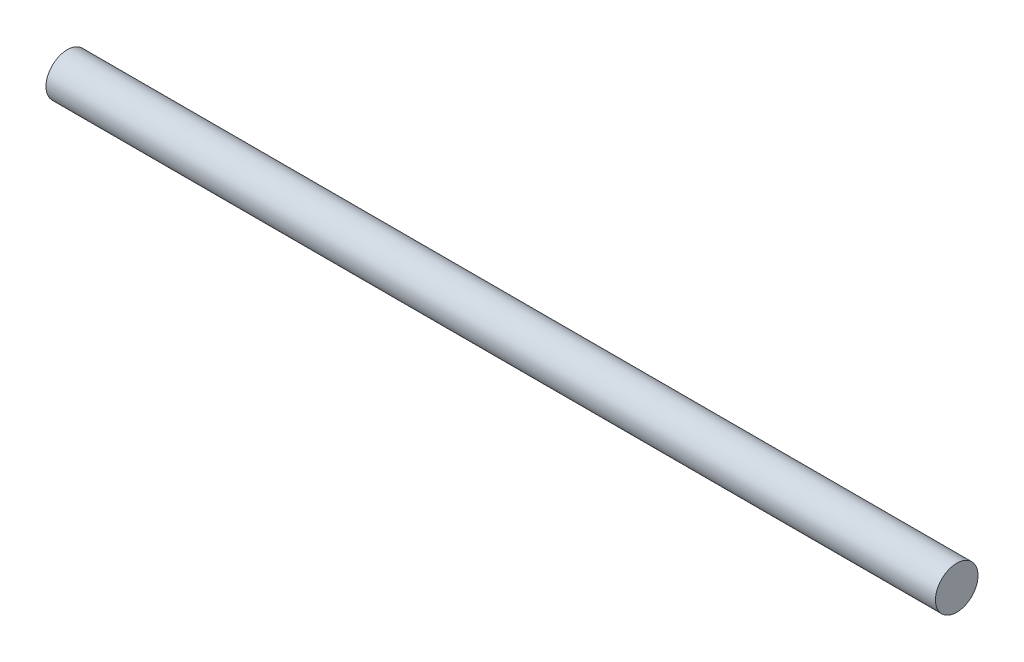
from build123d import *

# Parameters (mm, degrees)
SKETCH1_W = 106.68
SKETCH1_H = 2.5525


with BuildPart() as part:
    # Sketch1 → Revolve1 (revolve)
    with BuildSketch(Plane.XY, mode=Mode.PRIVATE) as revolve1_sk:
        with Locations((53.34, 1.27625)):
            Rectangle(SKETCH1_W, SKETCH1_H)
    revolve(revolve1_sk.sketch.rotate(Axis((106.68, 0, 0), (-1, 0, 0)), 180), axis=Axis((106.68, 0, 0), (-1, 0, 0)))


solid = part.part
